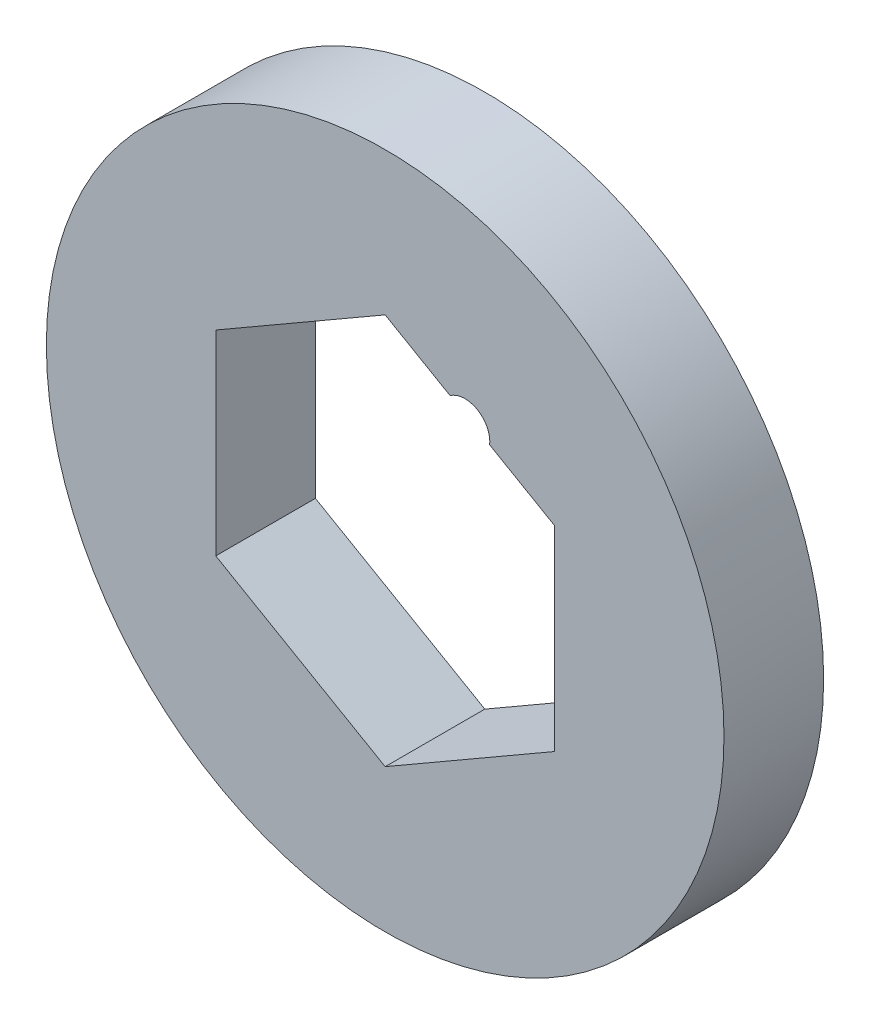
ISO-10303-21;
HEADER;
FILE_DESCRIPTION(('STEP AP214'),'2;1');
FILE_NAME('part.step','',(''),(''),'','','');
FILE_SCHEMA(('AUTOMOTIVE_DESIGN { 1 0 10303 214 1 1 1 1 }'));
ENDSEC;
DATA;
#1=APPLICATION_CONTEXT('core data for automotive mechanical design processes');
#2=APPLICATION_PROTOCOL_DEFINITION('international standard','automotive_design',2000,#1);
#3=PRODUCT_CONTEXT('',#1,'mechanical');
#4=PRODUCT('Part','Part','',(#3));
#5=PRODUCT_RELATED_PRODUCT_CATEGORY('part','',(#4));
#6=PRODUCT_DEFINITION_FORMATION('','',#4);
#7=PRODUCT_DEFINITION_CONTEXT('part definition',#1,'design');
#8=PRODUCT_DEFINITION('design','',#6,#7);
#9=PRODUCT_DEFINITION_SHAPE('','',#8);
#10=(LENGTH_UNIT() NAMED_UNIT(*) SI_UNIT(.MILLI.,.METRE.));
#11=(NAMED_UNIT(*) PLANE_ANGLE_UNIT() SI_UNIT($,.RADIAN.));
#12=(NAMED_UNIT(*) SI_UNIT($,.STERADIAN.) SOLID_ANGLE_UNIT());
#13=UNCERTAINTY_MEASURE_WITH_UNIT(LENGTH_MEASURE(1.E-05),#10,'distance_accuracy_value','');
#14=(GEOMETRIC_REPRESENTATION_CONTEXT(3) GLOBAL_UNCERTAINTY_ASSIGNED_CONTEXT((#13)) GLOBAL_UNIT_ASSIGNED_CONTEXT((#10,
#11,#12)) REPRESENTATION_CONTEXT('',''));
#15=CARTESIAN_POINT('',(0.,0.,0.));
#16=DIRECTION('',(0.,0.,1.));
#17=DIRECTION('',(1.,0.,0.));
#18=AXIS2_PLACEMENT_3D('',#15,#16,#17);
#19=CARTESIAN_POINT('',(8.5,4.90747728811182,5.));
#20=DIRECTION('',(-0.5,-0.866025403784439,0.));
#21=DIRECTION('',(0.866025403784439,-0.5,0.));
#22=AXIS2_PLACEMENT_3D('',#19,#20,#21);
#23=PLANE('',#22);
#24=DIRECTION('',(0.,0.,1.));
#25=VECTOR('',#24,1.);
#26=CARTESIAN_POINT('',(5.24215674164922,6.78839397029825,0.));
#27=LINE('',#26,#25);
#28=CARTESIAN_POINT('',(5.24215674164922,6.78839397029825,0.));
#29=VERTEX_POINT('',#28);
#30=CARTESIAN_POINT('',(5.24215674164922,6.78839397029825,5.));
#31=VERTEX_POINT('',#30);
#32=EDGE_CURVE('E11',#29,#31,#27,.T.);
#33=ORIENTED_EDGE('',*,*,#32,.F.);
#34=DIRECTION('',(-0.866025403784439,0.5,0.));
#35=VECTOR('',#34,1.);
#36=CARTESIAN_POINT('',(8.5,4.90747728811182,0.));
#37=LINE('',#36,#35);
#38=CARTESIAN_POINT('',(8.5,4.90747728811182,0.));
#39=VERTEX_POINT('',#38);
#40=EDGE_CURVE('E158',#39,#29,#37,.T.);
#41=ORIENTED_EDGE('',*,*,#40,.F.);
#42=DIRECTION('',(0.,0.,-1.));
#43=VECTOR('',#42,1.);
#44=CARTESIAN_POINT('',(8.5,4.90747728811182,5.));
#45=LINE('',#44,#43);
#46=CARTESIAN_POINT('',(8.5,4.90747728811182,5.));
#47=VERTEX_POINT('',#46);
#48=EDGE_CURVE('E116',#47,#39,#45,.T.);
#49=ORIENTED_EDGE('',*,*,#48,.F.);
#50=DIRECTION('',(-0.866025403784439,0.5,0.));
#51=VECTOR('',#50,1.);
#52=CARTESIAN_POINT('',(8.5,4.90747728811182,5.));
#53=LINE('',#52,#51);
#54=EDGE_CURVE('E110',#47,#31,#53,.T.);
#55=ORIENTED_EDGE('',*,*,#54,.T.);
#56=EDGE_LOOP('',(#33,#41,#49,#55));
#57=FACE_BOUND('',#56,.T.);
#58=ADVANCED_FACE('F36',(#57),#23,.T.);
#59=CARTESIAN_POINT('',(0.,0.,5.));
#60=DIRECTION('',(0.,0.,1.));
#61=DIRECTION('',(1.,0.,0.));
#62=AXIS2_PLACEMENT_3D('',#59,#60,#61);
#63=PLANE('',#62);
#64=CARTESIAN_POINT('',(4.,6.92820323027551,5.));
#65=DIRECTION('',(0.,0.,1.));
#66=DIRECTION('',(1.,0.,0.));
#67=AXIS2_PLACEMENT_3D('',#64,#65,#66);
#68=CIRCLE('',#67,1.25);
#69=CARTESIAN_POINT('',(3.25784325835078,7.93403789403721,5.));
#70=VERTEX_POINT('',#69);
#71=EDGE_CURVE('E50',#31,#70,#68,.T.);
#72=ORIENTED_EDGE('',*,*,#71,.F.);
#73=ORIENTED_EDGE('',*,*,#54,.F.);
#74=DIRECTION('',(0.,1.,0.));
#75=VECTOR('',#74,1.);
#76=CARTESIAN_POINT('',(8.5,-4.90747728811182,5.));
#77=LINE('',#76,#75);
#78=CARTESIAN_POINT('',(8.5,-4.90747728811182,5.));
#79=VERTEX_POINT('',#78);
#80=EDGE_CURVE('E130',#79,#47,#77,.T.);
#81=ORIENTED_EDGE('',*,*,#80,.F.);
#82=DIRECTION('',(0.866025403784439,0.5,0.));
#83=VECTOR('',#82,1.);
#84=CARTESIAN_POINT('',(0.,-9.81495457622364,5.));
#85=LINE('',#84,#83);
#86=CARTESIAN_POINT('',(0.,-9.81495457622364,5.));
#87=VERTEX_POINT('',#86);
#88=EDGE_CURVE('E128',#87,#79,#85,.T.);
#89=ORIENTED_EDGE('',*,*,#88,.F.);
#90=DIRECTION('',(0.866025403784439,-0.5,0.));
#91=VECTOR('',#90,1.);
#92=CARTESIAN_POINT('',(-8.5,-4.90747728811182,5.));
#93=LINE('',#92,#91);
#94=CARTESIAN_POINT('',(-8.5,-4.90747728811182,5.));
#95=VERTEX_POINT('',#94);
#96=EDGE_CURVE('E126',#95,#87,#93,.T.);
#97=ORIENTED_EDGE('',*,*,#96,.F.);
#98=DIRECTION('',(0.,-1.,0.));
#99=VECTOR('',#98,1.);
#100=CARTESIAN_POINT('',(-8.5,4.90747728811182,5.));
#101=LINE('',#100,#99);
#102=CARTESIAN_POINT('',(-8.5,4.90747728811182,5.));
#103=VERTEX_POINT('',#102);
#104=EDGE_CURVE('E119',#103,#95,#101,.T.);
#105=ORIENTED_EDGE('',*,*,#104,.F.);
#106=DIRECTION('',(-0.866025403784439,-0.5,0.));
#107=VECTOR('',#106,1.);
#108=CARTESIAN_POINT('',(0.,9.81495457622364,5.));
#109=LINE('',#108,#107);
#110=CARTESIAN_POINT('',(0.,9.81495457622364,5.));
#111=VERTEX_POINT('',#110);
#112=EDGE_CURVE('E117',#111,#103,#109,.T.);
#113=ORIENTED_EDGE('',*,*,#112,.F.);
#114=EDGE_CURVE('E112',#70,#111,#53,.T.);
#115=ORIENTED_EDGE('',*,*,#114,.F.);
#116=EDGE_LOOP('',(#72,#73,#81,#89,#97,#105,#113,#115));
#117=FACE_BOUND('',#116,.T.);
#118=CARTESIAN_POINT('',(0.,0.,5.));
#119=DIRECTION('',(0.,0.,1.));
#120=DIRECTION('',(1.,0.,0.));
#121=AXIS2_PLACEMENT_3D('',#118,#119,#120);
#122=CIRCLE('',#121,17.);
#123=CARTESIAN_POINT('',(17.,0.,5.));
#124=VERTEX_POINT('',#123);
#125=EDGE_CURVE('E147',#124,#124,#122,.T.);
#126=ORIENTED_EDGE('',*,*,#125,.T.);
#127=EDGE_LOOP('',(#126));
#128=FACE_BOUND('',#127,.T.);
#129=ADVANCED_FACE('F107',(#117,#128),#63,.T.);
#130=CARTESIAN_POINT('',(0.,0.,0.));
#131=DIRECTION('',(0.,0.,1.));
#132=DIRECTION('',(1.,0.,0.));
#133=AXIS2_PLACEMENT_3D('',#130,#131,#132);
#134=PLANE('',#133);
#135=CARTESIAN_POINT('',(0.,0.,0.));
#136=DIRECTION('',(0.,0.,1.));
#137=DIRECTION('',(1.,0.,0.));
#138=AXIS2_PLACEMENT_3D('',#135,#136,#137);
#139=CIRCLE('',#138,17.);
#140=CARTESIAN_POINT('',(17.,0.,0.));
#141=VERTEX_POINT('',#140);
#142=EDGE_CURVE('E143',#141,#141,#139,.T.);
#143=ORIENTED_EDGE('',*,*,#142,.F.);
#144=EDGE_LOOP('',(#143));
#145=FACE_BOUND('',#144,.T.);
#146=ORIENTED_EDGE('',*,*,#40,.T.);
#147=CARTESIAN_POINT('',(4.,6.92820323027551,0.));
#148=DIRECTION('',(0.,0.,1.));
#149=DIRECTION('',(1.,0.,0.));
#150=AXIS2_PLACEMENT_3D('',#147,#148,#149);
#151=CIRCLE('',#150,1.25);
#152=CARTESIAN_POINT('',(3.25784325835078,7.93403789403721,0.));
#153=VERTEX_POINT('',#152);
#154=EDGE_CURVE('E100',#29,#153,#151,.T.);
#155=ORIENTED_EDGE('',*,*,#154,.T.);
#156=CARTESIAN_POINT('',(0.,9.81495457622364,0.));
#157=VERTEX_POINT('',#156);
#158=EDGE_CURVE('E155',#153,#157,#37,.T.);
#159=ORIENTED_EDGE('',*,*,#158,.T.);
#160=DIRECTION('',(-0.866025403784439,-0.5,0.));
#161=VECTOR('',#160,1.);
#162=CARTESIAN_POINT('',(0.,9.81495457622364,0.));
#163=LINE('',#162,#161);
#164=CARTESIAN_POINT('',(-8.5,4.90747728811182,0.));
#165=VERTEX_POINT('',#164);
#166=EDGE_CURVE('E163',#157,#165,#163,.T.);
#167=ORIENTED_EDGE('',*,*,#166,.T.);
#168=DIRECTION('',(0.,-1.,0.));
#169=VECTOR('',#168,1.);
#170=CARTESIAN_POINT('',(-8.5,4.90747728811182,0.));
#171=LINE('',#170,#169);
#172=CARTESIAN_POINT('',(-8.5,-4.90747728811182,0.));
#173=VERTEX_POINT('',#172);
#174=EDGE_CURVE('E166',#165,#173,#171,.T.);
#175=ORIENTED_EDGE('',*,*,#174,.T.);
#176=DIRECTION('',(0.866025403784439,-0.5,0.));
#177=VECTOR('',#176,1.);
#178=CARTESIAN_POINT('',(-8.5,-4.90747728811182,0.));
#179=LINE('',#178,#177);
#180=CARTESIAN_POINT('',(0.,-9.81495457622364,0.));
#181=VERTEX_POINT('',#180);
#182=EDGE_CURVE('E169',#173,#181,#179,.T.);
#183=ORIENTED_EDGE('',*,*,#182,.T.);
#184=DIRECTION('',(0.866025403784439,0.5,0.));
#185=VECTOR('',#184,1.);
#186=CARTESIAN_POINT('',(0.,-9.81495457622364,0.));
#187=LINE('',#186,#185);
#188=CARTESIAN_POINT('',(8.5,-4.90747728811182,0.));
#189=VERTEX_POINT('',#188);
#190=EDGE_CURVE('E171',#181,#189,#187,.T.);
#191=ORIENTED_EDGE('',*,*,#190,.T.);
#192=DIRECTION('',(0.,1.,0.));
#193=VECTOR('',#192,1.);
#194=CARTESIAN_POINT('',(8.5,-4.90747728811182,0.));
#195=LINE('',#194,#193);
#196=EDGE_CURVE('E121',#189,#39,#195,.T.);
#197=ORIENTED_EDGE('',*,*,#196,.T.);
#198=EDGE_LOOP('',(#146,#155,#159,#167,#175,#183,#191,#197));
#199=FACE_BOUND('',#198,.T.);
#200=ADVANCED_FACE('F153',(#145,#199),#134,.F.);
#201=CARTESIAN_POINT('',(0.,0.,5.));
#202=DIRECTION('',(0.,0.,-1.));
#203=DIRECTION('',(-1.,0.,0.));
#204=AXIS2_PLACEMENT_3D('',#201,#202,#203);
#205=CYLINDRICAL_SURFACE('',#204,17.);
#206=ORIENTED_EDGE('',*,*,#125,.F.);
#207=EDGE_LOOP('',(#206));
#208=FACE_BOUND('',#207,.T.);
#209=ORIENTED_EDGE('',*,*,#142,.T.);
#210=EDGE_LOOP('',(#209));
#211=FACE_BOUND('',#210,.T.);
#212=ADVANCED_FACE('F38',(#208,#211),#205,.T.);
#213=DIRECTION('',(0.,0.,1.));
#214=VECTOR('',#213,1.);
#215=CARTESIAN_POINT('',(3.25784325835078,7.93403789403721,0.));
#216=LINE('',#215,#214);
#217=EDGE_CURVE('E44',#70,#153,#216,.F.);
#218=ORIENTED_EDGE('',*,*,#217,.F.);
#219=ORIENTED_EDGE('',*,*,#114,.T.);
#220=DIRECTION('',(0.,0.,-1.));
#221=VECTOR('',#220,1.);
#222=CARTESIAN_POINT('',(0.,9.81495457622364,5.));
#223=LINE('',#222,#221);
#224=EDGE_CURVE('E140',#111,#157,#223,.T.);
#225=ORIENTED_EDGE('',*,*,#224,.T.);
#226=ORIENTED_EDGE('',*,*,#158,.F.);
#227=EDGE_LOOP('',(#218,#219,#225,#226));
#228=FACE_BOUND('',#227,.T.);
#229=ADVANCED_FACE('F160',(#228),#23,.T.);
#230=CARTESIAN_POINT('',(0.,9.81495457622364,5.));
#231=DIRECTION('',(0.5,-0.866025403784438,0.));
#232=DIRECTION('',(0.866025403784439,0.5,0.));
#233=AXIS2_PLACEMENT_3D('',#230,#231,#232);
#234=PLANE('',#233);
#235=ORIENTED_EDGE('',*,*,#166,.F.);
#236=ORIENTED_EDGE('',*,*,#224,.F.);
#237=ORIENTED_EDGE('',*,*,#112,.T.);
#238=DIRECTION('',(0.,0.,-1.));
#239=VECTOR('',#238,1.);
#240=CARTESIAN_POINT('',(-8.5,4.90747728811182,5.));
#241=LINE('',#240,#239);
#242=EDGE_CURVE('E138',#103,#165,#241,.T.);
#243=ORIENTED_EDGE('',*,*,#242,.T.);
#244=EDGE_LOOP('',(#235,#236,#237,#243));
#245=FACE_BOUND('',#244,.T.);
#246=ADVANCED_FACE('F190',(#245),#234,.T.);
#247=CARTESIAN_POINT('',(-8.5,4.90747728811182,5.));
#248=DIRECTION('',(1.,0.,0.));
#249=DIRECTION('',(0.,0.,-1.));
#250=AXIS2_PLACEMENT_3D('',#247,#248,#249);
#251=PLANE('',#250);
#252=ORIENTED_EDGE('',*,*,#174,.F.);
#253=ORIENTED_EDGE('',*,*,#242,.F.);
#254=ORIENTED_EDGE('',*,*,#104,.T.);
#255=DIRECTION('',(0.,0.,-1.));
#256=VECTOR('',#255,1.);
#257=CARTESIAN_POINT('',(-8.5,-4.90747728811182,5.));
#258=LINE('',#257,#256);
#259=EDGE_CURVE('E136',#95,#173,#258,.T.);
#260=ORIENTED_EDGE('',*,*,#259,.T.);
#261=EDGE_LOOP('',(#252,#253,#254,#260));
#262=FACE_BOUND('',#261,.T.);
#263=ADVANCED_FACE('F187',(#262),#251,.T.);
#264=CARTESIAN_POINT('',(-8.5,-4.90747728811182,5.));
#265=DIRECTION('',(0.5,0.866025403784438,0.));
#266=DIRECTION('',(-0.866025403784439,0.5,0.));
#267=AXIS2_PLACEMENT_3D('',#264,#265,#266);
#268=PLANE('',#267);
#269=ORIENTED_EDGE('',*,*,#182,.F.);
#270=ORIENTED_EDGE('',*,*,#259,.F.);
#271=ORIENTED_EDGE('',*,*,#96,.T.);
#272=DIRECTION('',(0.,0.,-1.));
#273=VECTOR('',#272,1.);
#274=CARTESIAN_POINT('',(0.,-9.81495457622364,5.));
#275=LINE('',#274,#273);
#276=EDGE_CURVE('E134',#87,#181,#275,.T.);
#277=ORIENTED_EDGE('',*,*,#276,.T.);
#278=EDGE_LOOP('',(#269,#270,#271,#277));
#279=FACE_BOUND('',#278,.T.);
#280=ADVANCED_FACE('F183',(#279),#268,.T.);
#281=CARTESIAN_POINT('',(0.,-9.81495457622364,5.));
#282=DIRECTION('',(-0.5,0.866025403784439,0.));
#283=DIRECTION('',(-0.866025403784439,-0.5,0.));
#284=AXIS2_PLACEMENT_3D('',#281,#282,#283);
#285=PLANE('',#284);
#286=ORIENTED_EDGE('',*,*,#190,.F.);
#287=ORIENTED_EDGE('',*,*,#276,.F.);
#288=ORIENTED_EDGE('',*,*,#88,.T.);
#289=DIRECTION('',(0.,0.,-1.));
#290=VECTOR('',#289,1.);
#291=CARTESIAN_POINT('',(8.5,-4.90747728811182,5.));
#292=LINE('',#291,#290);
#293=EDGE_CURVE('E58',#79,#189,#292,.T.);
#294=ORIENTED_EDGE('',*,*,#293,.T.);
#295=EDGE_LOOP('',(#286,#287,#288,#294));
#296=FACE_BOUND('',#295,.T.);
#297=ADVANCED_FACE('F180',(#296),#285,.T.);
#298=CARTESIAN_POINT('',(8.5,-4.90747728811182,5.));
#299=DIRECTION('',(-1.,0.,0.));
#300=DIRECTION('',(0.,0.,1.));
#301=AXIS2_PLACEMENT_3D('',#298,#299,#300);
#302=PLANE('',#301);
#303=ORIENTED_EDGE('',*,*,#196,.F.);
#304=ORIENTED_EDGE('',*,*,#293,.F.);
#305=ORIENTED_EDGE('',*,*,#80,.T.);
#306=ORIENTED_EDGE('',*,*,#48,.T.);
#307=EDGE_LOOP('',(#303,#304,#305,#306));
#308=FACE_BOUND('',#307,.T.);
#309=ADVANCED_FACE('F174',(#308),#302,.T.);
#310=CARTESIAN_POINT('',(4.,6.92820323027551,0.));
#311=DIRECTION('',(0.,0.,1.));
#312=DIRECTION('',(1.,0.,0.));
#313=AXIS2_PLACEMENT_3D('',#310,#311,#312);
#314=CYLINDRICAL_SURFACE('',#313,1.25);
#315=ORIENTED_EDGE('',*,*,#32,.T.);
#316=ORIENTED_EDGE('',*,*,#71,.T.);
#317=ORIENTED_EDGE('',*,*,#217,.T.);
#318=ORIENTED_EDGE('',*,*,#154,.F.);
#319=EDGE_LOOP('',(#315,#316,#317,#318));
#320=FACE_BOUND('',#319,.T.);
#321=ADVANCED_FACE('F98',(#320),#314,.F.);
#322=CLOSED_SHELL('',(#58,#129,#200,#212,#229,#246,#263,#280,#297,#309,#321));
#323=MANIFOLD_SOLID_BREP('B2',#322);
#324=ADVANCED_BREP_SHAPE_REPRESENTATION('',(#18,#323),#14);
#325=SHAPE_DEFINITION_REPRESENTATION(#9,#324);
ENDSEC;
END-ISO-10303-21;
